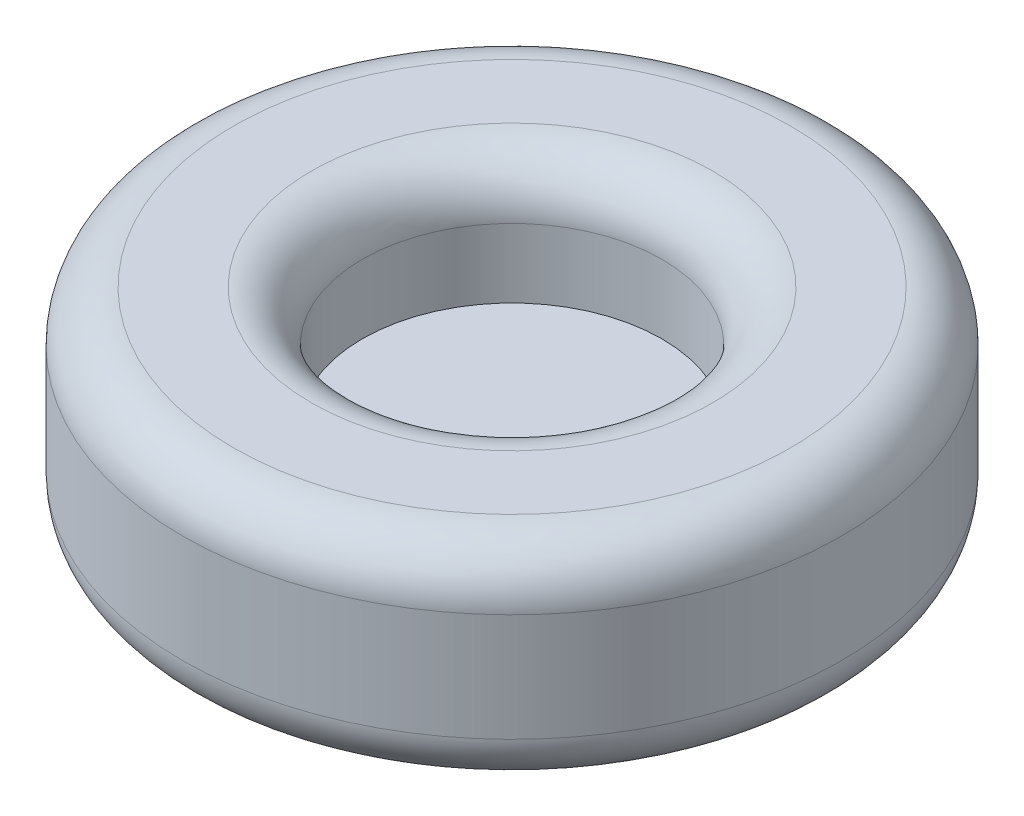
ISO-10303-21;
HEADER;
FILE_DESCRIPTION(('STEP AP214'),'2;1');
FILE_NAME('part.step','',(''),(''),'','','');
FILE_SCHEMA(('AUTOMOTIVE_DESIGN { 1 0 10303 214 1 1 1 1 }'));
ENDSEC;
DATA;
#1=APPLICATION_CONTEXT('core data for automotive mechanical design processes');
#2=APPLICATION_PROTOCOL_DEFINITION('international standard','automotive_design',2000,#1);
#3=PRODUCT_CONTEXT('',#1,'mechanical');
#4=PRODUCT('Part','Part','',(#3));
#5=PRODUCT_RELATED_PRODUCT_CATEGORY('part','',(#4));
#6=PRODUCT_DEFINITION_FORMATION('','',#4);
#7=PRODUCT_DEFINITION_CONTEXT('part definition',#1,'design');
#8=PRODUCT_DEFINITION('design','',#6,#7);
#9=PRODUCT_DEFINITION_SHAPE('','',#8);
#10=(LENGTH_UNIT() NAMED_UNIT(*) SI_UNIT(.MILLI.,.METRE.));
#11=(NAMED_UNIT(*) PLANE_ANGLE_UNIT() SI_UNIT($,.RADIAN.));
#12=(NAMED_UNIT(*) SI_UNIT($,.STERADIAN.) SOLID_ANGLE_UNIT());
#13=UNCERTAINTY_MEASURE_WITH_UNIT(LENGTH_MEASURE(1.E-05),#10,'distance_accuracy_value','');
#14=(GEOMETRIC_REPRESENTATION_CONTEXT(3) GLOBAL_UNCERTAINTY_ASSIGNED_CONTEXT((#13)) GLOBAL_UNIT_ASSIGNED_CONTEXT((#10,
#11,#12)) REPRESENTATION_CONTEXT('',''));
#15=CARTESIAN_POINT('',(0.,0.,0.));
#16=DIRECTION('',(0.,0.,1.));
#17=DIRECTION('',(1.,0.,0.));
#18=AXIS2_PLACEMENT_3D('',#15,#16,#17);
#19=CARTESIAN_POINT('',(0.,-76.2,0.));
#20=DIRECTION('',(0.,1.,0.));
#21=DIRECTION('',(0.,0.,1.));
#22=AXIS2_PLACEMENT_3D('',#19,#20,#21);
#23=CYLINDRICAL_SURFACE('',#22,279.4);
#24=CARTESIAN_POINT('',(0.,-33.02,0.));
#25=DIRECTION('',(0.,1.,0.));
#26=DIRECTION('',(0.,0.,1.));
#27=AXIS2_PLACEMENT_3D('',#24,#25,#26);
#28=CIRCLE('',#27,279.4);
#29=CARTESIAN_POINT('',(0.,-33.02,279.4));
#30=VERTEX_POINT('',#29);
#31=EDGE_CURVE('E51',#30,#30,#28,.T.);
#32=CARTESIAN_POINT('',(0.,58.42,0.));
#33=DIRECTION('',(0.,1.,0.));
#34=DIRECTION('',(0.,0.,1.));
#35=AXIS2_PLACEMENT_3D('',#32,#33,#34);
#36=CIRCLE('',#35,279.4);
#37=CARTESIAN_POINT('',(0.,58.42,279.4));
#38=VERTEX_POINT('',#37);
#39=EDGE_CURVE('E54',#38,#38,#36,.F.);
#40=CARTESIAN_POINT('',(0.,-33.02,279.4));
#41=CARTESIAN_POINT('',(0.,-32.0675,279.4));
#42=CARTESIAN_POINT('',(0.,-31.115,279.4));
#43=CARTESIAN_POINT('',(0.,-29.21,279.4));
#44=CARTESIAN_POINT('',(0.,-28.2575,279.4));
#45=CARTESIAN_POINT('',(0.,-26.3525,279.4));
#46=CARTESIAN_POINT('',(0.,-25.4,279.4));
#47=CARTESIAN_POINT('',(0.,-23.495,279.4));
#48=CARTESIAN_POINT('',(0.,-22.5425,279.4));
#49=CARTESIAN_POINT('',(0.,-20.6375,279.4));
#50=CARTESIAN_POINT('',(0.,-19.685,279.4));
#51=CARTESIAN_POINT('',(0.,-17.78,279.4));
#52=CARTESIAN_POINT('',(0.,-16.8275,279.4));
#53=CARTESIAN_POINT('',(0.,-14.9225,279.4));
#54=CARTESIAN_POINT('',(0.,-13.97,279.4));
#55=CARTESIAN_POINT('',(0.,-12.065,279.4));
#56=CARTESIAN_POINT('',(0.,-11.1125,279.4));
#57=CARTESIAN_POINT('',(0.,-9.2075,279.4));
#58=CARTESIAN_POINT('',(0.,-8.255,279.4));
#59=CARTESIAN_POINT('',(0.,-6.35,279.4));
#60=CARTESIAN_POINT('',(0.,-5.3975,279.4));
#61=CARTESIAN_POINT('',(0.,-3.4925,279.4));
#62=CARTESIAN_POINT('',(0.,-2.54000000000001,279.4));
#63=CARTESIAN_POINT('',(0.,-0.635000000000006,279.4));
#64=CARTESIAN_POINT('',(0.,0.317499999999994,279.4));
#65=CARTESIAN_POINT('',(0.,2.22249999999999,279.4));
#66=CARTESIAN_POINT('',(0.,3.17499999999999,279.4));
#67=CARTESIAN_POINT('',(0.,5.07999999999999,279.4));
#68=CARTESIAN_POINT('',(0.,6.03249999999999,279.4));
#69=CARTESIAN_POINT('',(0.,7.93749999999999,279.4));
#70=CARTESIAN_POINT('',(0.,8.89,279.4));
#71=CARTESIAN_POINT('',(0.,10.795,279.4));
#72=CARTESIAN_POINT('',(0.,11.7475,279.4));
#73=CARTESIAN_POINT('',(0.,13.6525,279.4));
#74=CARTESIAN_POINT('',(0.,14.605,279.4));
#75=CARTESIAN_POINT('',(0.,16.51,279.4));
#76=CARTESIAN_POINT('',(0.,17.4625,279.4));
#77=CARTESIAN_POINT('',(0.,19.3675,279.4));
#78=CARTESIAN_POINT('',(0.,20.32,279.4));
#79=CARTESIAN_POINT('',(0.,22.225,279.4));
#80=CARTESIAN_POINT('',(0.,23.1775,279.4));
#81=CARTESIAN_POINT('',(0.,25.0825,279.4));
#82=CARTESIAN_POINT('',(0.,26.035,279.4));
#83=CARTESIAN_POINT('',(0.,27.94,279.4));
#84=CARTESIAN_POINT('',(0.,28.8925,279.4));
#85=CARTESIAN_POINT('',(0.,30.7975,279.4));
#86=CARTESIAN_POINT('',(0.,31.75,279.4));
#87=CARTESIAN_POINT('',(0.,33.655,279.4));
#88=CARTESIAN_POINT('',(0.,34.6075,279.4));
#89=CARTESIAN_POINT('',(0.,36.5125,279.4));
#90=CARTESIAN_POINT('',(0.,37.465,279.4));
#91=CARTESIAN_POINT('',(0.,39.37,279.4));
#92=CARTESIAN_POINT('',(0.,40.3225,279.4));
#93=CARTESIAN_POINT('',(0.,42.2275,279.4));
#94=CARTESIAN_POINT('',(0.,43.18,279.4));
#95=CARTESIAN_POINT('',(0.,45.085,279.4));
#96=CARTESIAN_POINT('',(0.,46.0375,279.4));
#97=CARTESIAN_POINT('',(0.,47.9425,279.4));
#98=CARTESIAN_POINT('',(0.,48.895,279.4));
#99=CARTESIAN_POINT('',(0.,50.8,279.4));
#100=CARTESIAN_POINT('',(0.,51.7525,279.4));
#101=CARTESIAN_POINT('',(0.,53.6575,279.4));
#102=CARTESIAN_POINT('',(0.,54.61,279.4));
#103=CARTESIAN_POINT('',(0.,56.515,279.4));
#104=CARTESIAN_POINT('',(0.,57.4675,279.4));
#105=CARTESIAN_POINT('',(0.,58.42,279.4));
#106=B_SPLINE_CURVE_WITH_KNOTS('',3,(#40,#41,#42,#43,#44,#45,#46,#47,#48,#49,#50,#51,#52,#53,
#54,#55,#56,#57,#58,#59,#60,#61,#62,#63,#64,#65,#66,#67,#68,#69,#70,#71,#72,#73,#74,#75,#76,#77,
#78,#79,#80,#81,#82,#83,#84,#85,#86,#87,#88,#89,#90,#91,#92,#93,#94,#95,#96,#97,#98,#99,#100,
#101,#102,#103,#104,#105),.UNSPECIFIED.,.F.,.F.,(4,2,2,2,2,2,2,2,2,2,2,2,2,2,2,2,2,2,2,2,2,2,2,
2,2,2,2,2,2,2,2,2,4),(0.,2.8575,5.715,8.5725,11.43,14.2875,17.145,20.0025,22.86,25.7175,28.575,
31.4325,34.29,37.1475,40.005,42.8625,45.72,48.5775,51.435,54.2925,57.15,60.0075,62.865,65.7225,
68.58,71.4375,74.295,77.1525,80.01,82.8675,85.725,88.5825,91.44),.UNSPECIFIED.);
#107=EDGE_CURVE('BSEAM31',#30,#38,#106,.T.);
#108=ORIENTED_EDGE('',*,*,#31,.T.);
#109=ORIENTED_EDGE('',*,*,#39,.T.);
#110=ORIENTED_EDGE('',*,*,#107,.T.);
#111=ORIENTED_EDGE('',*,*,#107,.F.);
#112=EDGE_LOOP('',(#108,#110,#109,#111));
#113=FACE_BOUND('',#112,.T.);
#114=ADVANCED_FACE('F31',(#113),#23,.T.);
#115=CARTESIAN_POINT('',(0.,-76.2,0.));
#116=DIRECTION('',(0.,1.,0.));
#117=DIRECTION('',(0.,0.,1.));
#118=AXIS2_PLACEMENT_3D('',#115,#116,#117);
#119=PLANE('',#118);
#120=CARTESIAN_POINT('',(0.,-76.2,0.));
#121=DIRECTION('',(0.,1.,0.));
#122=DIRECTION('',(0.,0.,1.));
#123=AXIS2_PLACEMENT_3D('',#120,#121,#122);
#124=CIRCLE('',#123,236.22);
#125=CARTESIAN_POINT('',(0.,-76.2,236.22));
#126=VERTEX_POINT('',#125);
#127=EDGE_CURVE('E46',#126,#126,#124,.F.);
#128=ORIENTED_EDGE('',*,*,#127,.T.);
#129=EDGE_LOOP('',(#128));
#130=FACE_BOUND('',#129,.T.);
#131=ADVANCED_FACE('F76',(#130),#119,.F.);
#132=CARTESIAN_POINT('',(0.,101.6,0.));
#133=DIRECTION('',(0.,1.,0.));
#134=DIRECTION('',(0.,0.,1.));
#135=AXIS2_PLACEMENT_3D('',#132,#133,#134);
#136=PLANE('',#135);
#137=CARTESIAN_POINT('',(0.,101.6,0.));
#138=DIRECTION('',(0.,1.,0.));
#139=DIRECTION('',(0.,0.,1.));
#140=AXIS2_PLACEMENT_3D('',#137,#138,#139);
#141=CIRCLE('',#140,170.18);
#142=CARTESIAN_POINT('',(0.,101.6,170.18));
#143=VERTEX_POINT('',#142);
#144=EDGE_CURVE('E10',#143,#143,#141,.F.);
#145=ORIENTED_EDGE('',*,*,#144,.T.);
#146=EDGE_LOOP('',(#145));
#147=FACE_BOUND('',#146,.T.);
#148=CARTESIAN_POINT('',(0.,101.6,0.));
#149=DIRECTION('',(0.,1.,0.));
#150=DIRECTION('',(0.,0.,1.));
#151=AXIS2_PLACEMENT_3D('',#148,#149,#150);
#152=CIRCLE('',#151,236.22);
#153=CARTESIAN_POINT('',(0.,101.6,236.22));
#154=VERTEX_POINT('',#153);
#155=EDGE_CURVE('E42',#154,#154,#152,.T.);
#156=ORIENTED_EDGE('',*,*,#155,.T.);
#157=EDGE_LOOP('',(#156));
#158=FACE_BOUND('',#157,.T.);
#159=ADVANCED_FACE('F82',(#147,#158),#136,.T.);
#160=CARTESIAN_POINT('',(0.,-33.02,0.));
#161=DIRECTION('',(0.,1.,0.));
#162=DIRECTION('',(0.,0.,1.));
#163=AXIS2_PLACEMENT_3D('',#160,#161,#162);
#164=TOROIDAL_SURFACE('',#163,236.22,43.18);
#165=ORIENTED_EDGE('',*,*,#127,.F.);
#166=EDGE_LOOP('',(#165));
#167=FACE_BOUND('',#166,.T.);
#168=ORIENTED_EDGE('',*,*,#31,.F.);
#169=EDGE_LOOP('',(#168));
#170=FACE_BOUND('',#169,.T.);
#171=ADVANCED_FACE('F72',(#167,#170),#164,.T.);
#172=CARTESIAN_POINT('',(0.,58.42,0.));
#173=DIRECTION('',(0.,1.,0.));
#174=DIRECTION('',(0.,0.,1.));
#175=AXIS2_PLACEMENT_3D('',#172,#173,#174);
#176=TOROIDAL_SURFACE('',#175,236.22,43.18);
#177=ORIENTED_EDGE('',*,*,#39,.F.);
#178=EDGE_LOOP('',(#177));
#179=FACE_BOUND('',#178,.T.);
#180=ORIENTED_EDGE('',*,*,#155,.F.);
#181=EDGE_LOOP('',(#180));
#182=FACE_BOUND('',#181,.T.);
#183=ADVANCED_FACE('F65',(#179,#182),#176,.T.);
#184=CARTESIAN_POINT('',(0.,0.,0.));
#185=DIRECTION('',(0.,1.,0.));
#186=DIRECTION('',(0.,0.,1.));
#187=AXIS2_PLACEMENT_3D('',#184,#185,#186);
#188=CYLINDRICAL_SURFACE('',#187,127.);
#189=CARTESIAN_POINT('',(0.,58.42,0.));
#190=DIRECTION('',(0.,1.,0.));
#191=DIRECTION('',(0.,0.,1.));
#192=AXIS2_PLACEMENT_3D('',#189,#190,#191);
#193=CIRCLE('',#192,127.);
#194=CARTESIAN_POINT('',(0.,58.42,127.));
#195=VERTEX_POINT('',#194);
#196=EDGE_CURVE('E38',#195,#195,#193,.T.);
#197=ORIENTED_EDGE('',*,*,#196,.T.);
#198=EDGE_LOOP('',(#197));
#199=FACE_BOUND('',#198,.T.);
#200=CARTESIAN_POINT('',(0.,0.,0.));
#201=DIRECTION('',(0.,1.,0.));
#202=DIRECTION('',(0.,0.,1.));
#203=AXIS2_PLACEMENT_3D('',#200,#201,#202);
#204=CIRCLE('',#203,127.);
#205=CARTESIAN_POINT('',(0.,0.,127.));
#206=VERTEX_POINT('',#205);
#207=EDGE_CURVE('E57',#206,#206,#204,.T.);
#208=ORIENTED_EDGE('',*,*,#207,.F.);
#209=EDGE_LOOP('',(#208));
#210=FACE_BOUND('',#209,.T.);
#211=ADVANCED_FACE('F63',(#199,#210),#188,.F.);
#212=CARTESIAN_POINT('',(0.,0.,0.));
#213=DIRECTION('',(0.,1.,0.));
#214=DIRECTION('',(0.,0.,1.));
#215=AXIS2_PLACEMENT_3D('',#212,#213,#214);
#216=PLANE('',#215);
#217=ORIENTED_EDGE('',*,*,#207,.T.);
#218=EDGE_LOOP('',(#217));
#219=FACE_BOUND('',#218,.T.);
#220=ADVANCED_FACE('F61',(#219),#216,.T.);
#221=CARTESIAN_POINT('',(0.,58.42,0.));
#222=DIRECTION('',(0.,1.,0.));
#223=DIRECTION('',(0.,0.,1.));
#224=AXIS2_PLACEMENT_3D('',#221,#222,#223);
#225=TOROIDAL_SURFACE('',#224,170.18,43.18);
#226=ORIENTED_EDGE('',*,*,#144,.F.);
#227=EDGE_LOOP('',(#226));
#228=FACE_BOUND('',#227,.T.);
#229=ORIENTED_EDGE('',*,*,#196,.F.);
#230=EDGE_LOOP('',(#229));
#231=FACE_BOUND('',#230,.T.);
#232=ADVANCED_FACE('F33',(#228,#231),#225,.T.);
#233=CLOSED_SHELL('',(#114,#131,#159,#171,#183,#211,#220,#232));
#234=MANIFOLD_SOLID_BREP('B2',#233);
#235=ADVANCED_BREP_SHAPE_REPRESENTATION('',(#18,#234),#14);
#236=SHAPE_DEFINITION_REPRESENTATION(#9,#235);
ENDSEC;
END-ISO-10303-21;
